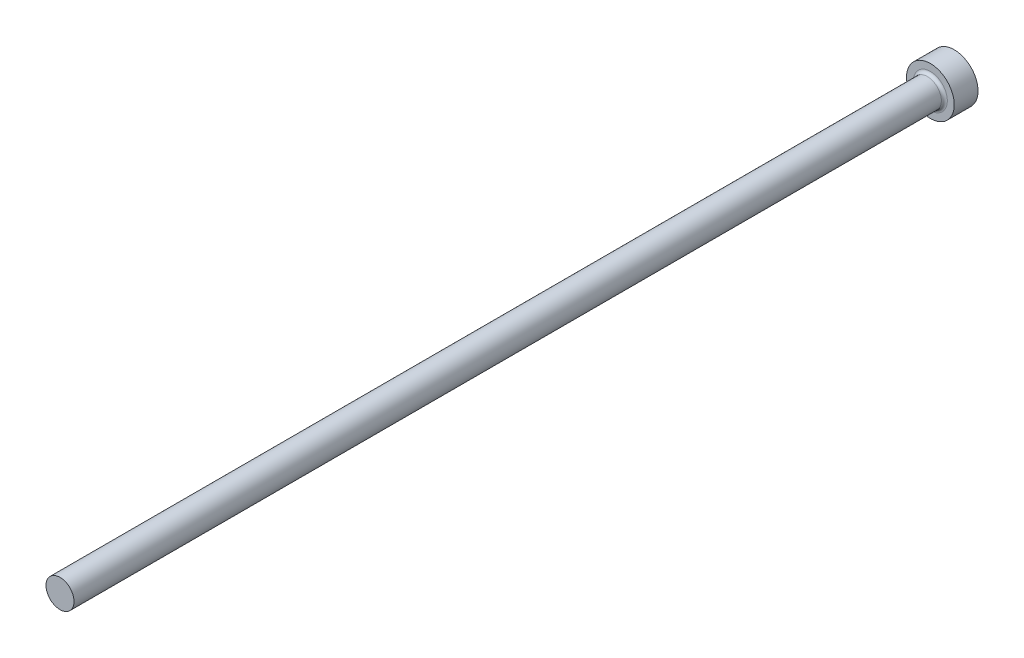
from build123d import *

# Parameters (mm, degrees)
FILLET1_R = 0.5


with BuildPart() as part:
    # FV → Revolve1 (revolve)
    with BuildSketch(Plane(origin=(0, 0, 0), x_dir=(1, 0, 0), z_dir=(0, 1, 0)), mode=Mode.PRIVATE) as revolve1_sk:
        Polygon((0, 0), (4, 0), (4, -4), (2.35, -4), (2.35, -150), (0, -150), align=None)
    revolve(revolve1_sk.sketch.rotate(Axis((0, 0, -9.033228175), (0, 0, 1)), 180), axis=Axis((0, 0, -9.033228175), (0, 0, 1)))

    # Fillet1
    fillet1_edges = [part.edges().sort_by_distance(p)[0] for p in [
        (2.35, 0, 4),
    ]]
    fillet(fillet1_edges, radius=FILLET1_R)


solid = part.part
